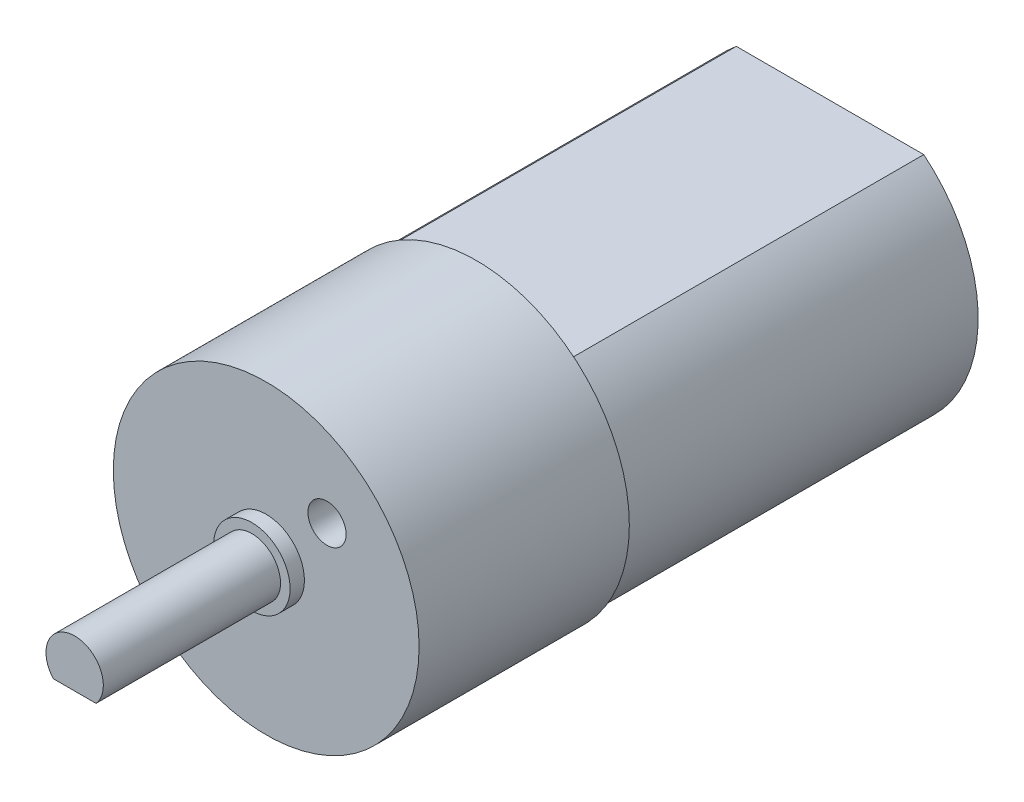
from build123d import *

# Parameters (mm, degrees)
CROQUIS1_R              = 8
SALIENTE_EXTRUIR1_DEPTH = 11
CROQUIS2_R              = 7.75
SALIENTE_EXTRUIR2_DEPTH = 18.5
CROQUIS3_W              = 9.810708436
CROQUIS3_H              = 3.631161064
CORTAR_EXTRUIR1_DEPTH   = 18.5
CROQUIS4_R              = 2
SALIENTE_EXTRUIR3_DEPTH = 0.75
CROQUIS5_R              = 1.5
SALIENTE_EXTRUIR4_DEPTH = 15
CROQUIS6_W              = 2.236067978
CROQUIS6_H              = 0.629010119
CORTAR_EXTRUIR2_DEPTH   = 15
CROQUIS8_R              = 1
CORTAR_EXTRUIR3_DEPTH   = 5
SKETCH1_W               = 25.318613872
SKETCH1_H               = 14.050246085
CUT_EXTRUDE1_DEPTH      = 10


with BuildPart() as part:
    # Croquis1 → Saliente-Extruir1 (new body)
    with BuildSketch(Plane.XY):
        Circle(CROQUIS1_R)
    extrude(amount=SALIENTE_EXTRUIR1_DEPTH)

    # Croquis2 → Saliente-Extruir2 (add)
    with BuildSketch(Plane(origin=(0, 0, 0), x_dir=(-1, 0, 0), z_dir=(0, 0, -1))):
        with Locations(Location((0, 0, 0), (0, 0, 180))):
            Circle(CROQUIS2_R)
    extrude(amount=SALIENTE_EXTRUIR2_DEPTH)

    # Croquis3 → Cortar-Extruir1 (cut)
    with BuildSketch(Plane(origin=(0, 0, -18.5), x_dir=(-1, 0, 0), z_dir=(0, 0, -1))):
        Polygon((-4.905354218, 6), (-4.905354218, 7.686538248), (-4.905354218, 8.716087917), (4.905354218, 8.716087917), (4.905354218, 7.686538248), (4.905354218, 6), align=None)
        with Locations((0, -7.815580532)):
            Rectangle(CROQUIS3_W, CROQUIS3_H)
    extrude(amount=-CORTAR_EXTRUIR1_DEPTH, mode=Mode.SUBTRACT)

    # Croquis4 → Saliente-Extruir3 (add)
    with BuildSketch(Plane.XY.offset(11)):
        Circle(CROQUIS4_R)
    extrude(amount=SALIENTE_EXTRUIR3_DEPTH)

    # Croquis5 → Saliente-Extruir4 (add)
    with BuildSketch(Plane.XY.offset(11.75)):
        Circle(CROQUIS5_R)
    extrude(amount=SALIENTE_EXTRUIR4_DEPTH)

    # Croquis6 → Cortar-Extruir2 (cut)
    with BuildSketch(Plane.XY.offset(26.75)):
        with Locations((0, -1.31450506)):
            Rectangle(CROQUIS6_W, CROQUIS6_H)
    extrude(amount=-CORTAR_EXTRUIR2_DEPTH, mode=Mode.SUBTRACT)

    # Croquis8 → Cortar-Extruir3 (cut)
    with BuildSketch(Plane.XY.offset(11)):
        with Locations((-3.181980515, -3.181980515)):
            Circle(CROQUIS8_R)
        with Locations((3.181980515, 3.181980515)):
            Circle(CROQUIS8_R)
    extrude(amount=-CORTAR_EXTRUIR3_DEPTH, mode=Mode.SUBTRACT)

    # Sketch1 → Cut-Extrude1 (cut)
    with BuildSketch(Plane(origin=(0, -1, 0), x_dir=(-1, 0, 0), z_dir=(0, -1, 0))):
        with Locations((2.113986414, -28.046123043)):
            Rectangle(SKETCH1_W, SKETCH1_H)
    extrude(amount=-CUT_EXTRUDE1_DEPTH, mode=Mode.SUBTRACT)


solid = part.part
